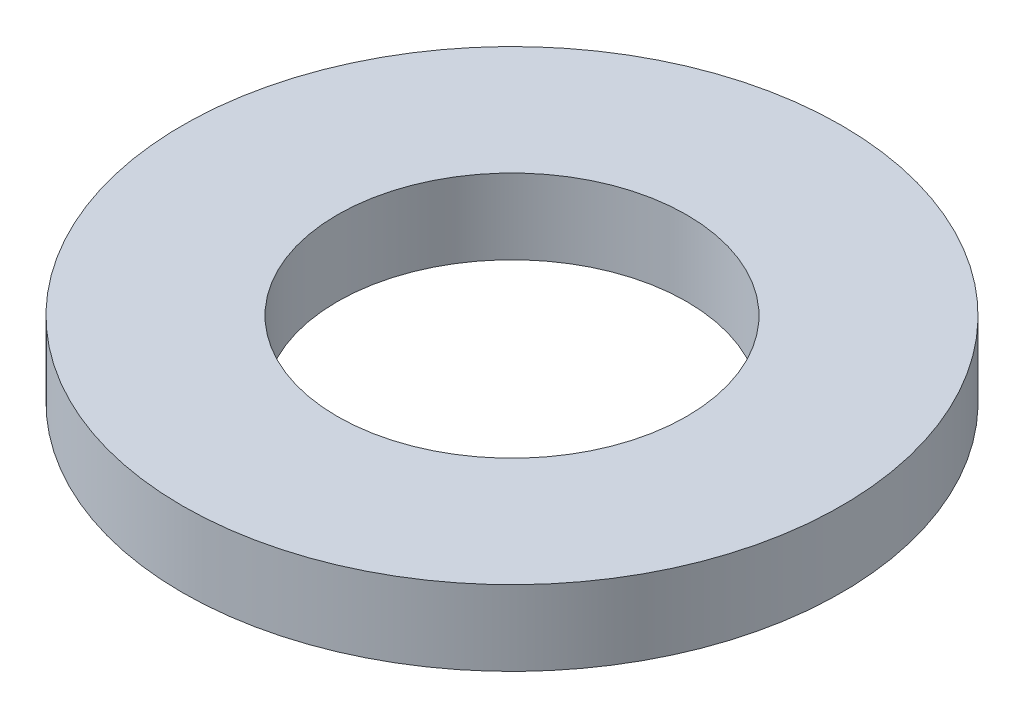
ISO-10303-21;
HEADER;
FILE_DESCRIPTION(('STEP AP214'),'2;1');
FILE_NAME('part.step','',(''),(''),'','','');
FILE_SCHEMA(('AUTOMOTIVE_DESIGN { 1 0 10303 214 1 1 1 1 }'));
ENDSEC;
DATA;
#1=APPLICATION_CONTEXT('core data for automotive mechanical design processes');
#2=APPLICATION_PROTOCOL_DEFINITION('international standard','automotive_design',2000,#1);
#3=PRODUCT_CONTEXT('',#1,'mechanical');
#4=PRODUCT('Part','Part','',(#3));
#5=PRODUCT_RELATED_PRODUCT_CATEGORY('part','',(#4));
#6=PRODUCT_DEFINITION_FORMATION('','',#4);
#7=PRODUCT_DEFINITION_CONTEXT('part definition',#1,'design');
#8=PRODUCT_DEFINITION('design','',#6,#7);
#9=PRODUCT_DEFINITION_SHAPE('','',#8);
#10=(LENGTH_UNIT() NAMED_UNIT(*) SI_UNIT(.MILLI.,.METRE.));
#11=(NAMED_UNIT(*) PLANE_ANGLE_UNIT() SI_UNIT($,.RADIAN.));
#12=(NAMED_UNIT(*) SI_UNIT($,.STERADIAN.) SOLID_ANGLE_UNIT());
#13=UNCERTAINTY_MEASURE_WITH_UNIT(LENGTH_MEASURE(1.E-05),#10,'distance_accuracy_value','');
#14=(GEOMETRIC_REPRESENTATION_CONTEXT(3) GLOBAL_UNCERTAINTY_ASSIGNED_CONTEXT((#13)) GLOBAL_UNIT_ASSIGNED_CONTEXT((#10,
#11,#12)) REPRESENTATION_CONTEXT('',''));
#15=CARTESIAN_POINT('',(0.,0.,0.));
#16=DIRECTION('',(0.,0.,1.));
#17=DIRECTION('',(1.,0.,0.));
#18=AXIS2_PLACEMENT_3D('',#15,#16,#17);
#19=CARTESIAN_POINT('',(0.,1.4478,0.));
#20=DIRECTION('',(0.,1.,0.));
#21=DIRECTION('',(0.,0.,1.));
#22=AXIS2_PLACEMENT_3D('',#19,#20,#21);
#23=PLANE('',#22);
#24=CARTESIAN_POINT('',(0.,1.4478,0.));
#25=DIRECTION('',(0.,1.,0.));
#26=DIRECTION('',(0.,0.,1.));
#27=AXIS2_PLACEMENT_3D('',#24,#25,#26);
#28=CIRCLE('',#27,6.35);
#29=CARTESIAN_POINT('',(0.,1.4478,6.35));
#30=VERTEX_POINT('',#29);
#31=EDGE_CURVE('E10',#30,#30,#28,.T.);
#32=ORIENTED_EDGE('',*,*,#31,.T.);
#33=EDGE_LOOP('',(#32));
#34=FACE_BOUND('',#33,.T.);
#35=CARTESIAN_POINT('',(0.,1.4478,0.));
#36=DIRECTION('',(0.,1.,0.));
#37=DIRECTION('',(0.,0.,1.));
#38=AXIS2_PLACEMENT_3D('',#35,#36,#37);
#39=CIRCLE('',#38,3.3655);
#40=CARTESIAN_POINT('',(0.,1.4478,3.3655));
#41=VERTEX_POINT('',#40);
#42=EDGE_CURVE('E41',#41,#41,#39,.T.);
#43=ORIENTED_EDGE('',*,*,#42,.F.);
#44=EDGE_LOOP('',(#43));
#45=FACE_BOUND('',#44,.T.);
#46=ADVANCED_FACE('F30',(#34,#45),#23,.T.);
#47=CARTESIAN_POINT('',(0.,0.,0.));
#48=DIRECTION('',(0.,1.,0.));
#49=DIRECTION('',(0.,0.,1.));
#50=AXIS2_PLACEMENT_3D('',#47,#48,#49);
#51=PLANE('',#50);
#52=CARTESIAN_POINT('',(0.,0.,0.));
#53=DIRECTION('',(0.,1.,0.));
#54=DIRECTION('',(0.,0.,1.));
#55=AXIS2_PLACEMENT_3D('',#52,#53,#54);
#56=CIRCLE('',#55,6.35);
#57=CARTESIAN_POINT('',(0.,0.,6.35));
#58=VERTEX_POINT('',#57);
#59=EDGE_CURVE('E34',#58,#58,#56,.T.);
#60=ORIENTED_EDGE('',*,*,#59,.F.);
#61=EDGE_LOOP('',(#60));
#62=FACE_BOUND('',#61,.T.);
#63=CARTESIAN_POINT('',(0.,0.,0.));
#64=DIRECTION('',(0.,1.,0.));
#65=DIRECTION('',(0.,0.,1.));
#66=AXIS2_PLACEMENT_3D('',#63,#64,#65);
#67=CIRCLE('',#66,3.3655);
#68=CARTESIAN_POINT('',(0.,0.,3.3655));
#69=VERTEX_POINT('',#68);
#70=EDGE_CURVE('E43',#69,#69,#67,.T.);
#71=ORIENTED_EDGE('',*,*,#70,.T.);
#72=EDGE_LOOP('',(#71));
#73=FACE_BOUND('',#72,.T.);
#74=ADVANCED_FACE('F53',(#62,#73),#51,.F.);
#75=CARTESIAN_POINT('',(0.,1.4478,0.));
#76=DIRECTION('',(0.,-1.,0.));
#77=DIRECTION('',(0.,0.,-1.));
#78=AXIS2_PLACEMENT_3D('',#75,#76,#77);
#79=CYLINDRICAL_SURFACE('',#78,6.35);
#80=ORIENTED_EDGE('',*,*,#31,.F.);
#81=EDGE_LOOP('',(#80));
#82=FACE_BOUND('',#81,.T.);
#83=ORIENTED_EDGE('',*,*,#59,.T.);
#84=EDGE_LOOP('',(#83));
#85=FACE_BOUND('',#84,.T.);
#86=ADVANCED_FACE('F32',(#82,#85),#79,.T.);
#87=CARTESIAN_POINT('',(0.,1.4478,0.));
#88=DIRECTION('',(0.,-1.,0.));
#89=DIRECTION('',(0.,0.,-1.));
#90=AXIS2_PLACEMENT_3D('',#87,#88,#89);
#91=CYLINDRICAL_SURFACE('',#90,3.3655);
#92=ORIENTED_EDGE('',*,*,#42,.T.);
#93=EDGE_LOOP('',(#92));
#94=FACE_BOUND('',#93,.T.);
#95=ORIENTED_EDGE('',*,*,#70,.F.);
#96=EDGE_LOOP('',(#95));
#97=FACE_BOUND('',#96,.T.);
#98=ADVANCED_FACE('F49',(#94,#97),#91,.F.);
#99=CLOSED_SHELL('',(#46,#74,#86,#98));
#100=MANIFOLD_SOLID_BREP('B2',#99);
#101=ADVANCED_BREP_SHAPE_REPRESENTATION('',(#18,#100),#14);
#102=SHAPE_DEFINITION_REPRESENTATION(#9,#101);
ENDSEC;
END-ISO-10303-21;
